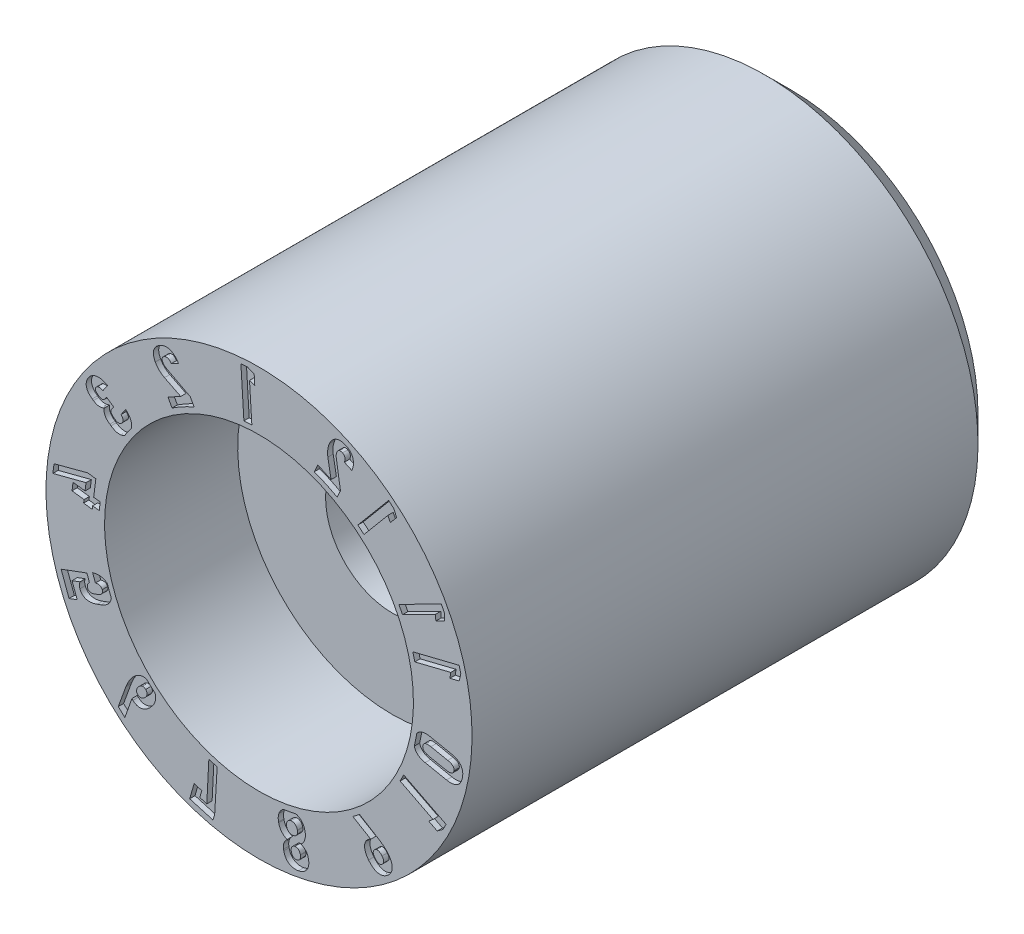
from build123d import *

# Parameters (mm, degrees)
CUT_EXTRUDE1_DEPTH = 0.1


with BuildPart() as part:
    # Sketch1 → Revolve1 (revolve)
    with BuildSketch(Plane(origin=(0, 0, 0), x_dir=(0, 0, -1), z_dir=(1, 0, 0)), mode=Mode.PRIVATE) as revolve1_sk:
        Polygon((10, 1.25), (10, 3.5), (9.5, 4), (0, 4), (0, 2.9), (2.5, 2.9), (2.5, 1.25), align=None)
    revolve(revolve1_sk.sketch.rotate(Axis((0, 0, 0), (0, 0, -1)), 180), axis=Axis((0, 0, 0), (0, 0, -1)))

    # Sketch2 → Cut-Extrude1 (cut)
    # profile 1 of 15: a face of its own
    with BuildSketch(Plane(origin=(0, 0, 0), x_dir=(0, 1, 0), z_dir=(0, 0, 1))):
        Polygon((2.982259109, 0.28374065), (2.991601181, 0.134442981), (3.692433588, 0.178186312), (3.65680991, 0.079246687), (3.837113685, 0.090453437), (3.890374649, 0.212314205), (3.882299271, 0.339773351), align=None)
    # profile 2 of 15: a face of its own
    with BuildSketch(Plane(origin=(0, 0, 0), x_dir=(0, 1, 0), z_dir=(0, 0, 1))):
        with BuildLine():
            ThreePointArc((2.516770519, 1.632748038), (2.636967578, 1.430525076), (2.740949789, 1.219505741))
            Line((2.740949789, 1.219505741), (2.870867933, 1.28958464))
            Line((2.870867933, 1.28958464), (3.098292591, 1.722412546))
            add(Edge.make_bspline(
                [(3.098292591, 1.722412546), (3.107762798, 1.741145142), (3.122587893, 1.762669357), (3.14360978, 1.78494197), (3.157631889, 1.796633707), (3.168218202, 1.804667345), (3.176001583, 1.808504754)],
                knots=[0, 0, 0, 0, 0.534647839, 0.661605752, 0.780088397, 1, 1, 1, 1], degree=3))
            Line((3.176001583, 1.808504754), (3.177066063, 1.80912174))
            add(Edge.make_bspline(
                [(3.177066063, 1.80912174), (3.186734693, 1.813957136), (3.201666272, 1.82045341), (3.222385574, 1.820860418), (3.236632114, 1.818048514), (3.249931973, 1.811876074), (3.266984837, 1.798993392), (3.276504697, 1.785186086), (3.281813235, 1.775123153)],
                knots=[0, 0, 0, 0, 0.26216042, 0.377951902, 0.491640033, 0.607227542, 0.726090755, 1, 1, 1, 1], degree=3))
            add(Edge.make_bspline(
                [(3.281813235, 1.775123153), (3.287445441, 1.765062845), (3.292717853, 1.748313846), (3.291602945, 1.725291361), (3.286603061, 1.708422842), (3.277835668, 1.692070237), (3.260848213, 1.669645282), (3.243398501, 1.655951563), (3.230864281, 1.647278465)],
                knots=[0, 0, 0, 0, 0.22678653, 0.33568016, 0.449024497, 0.569877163, 0.698822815, 1, 1, 1, 1], degree=3))
            Line((3.230864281, 1.647278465), (3.230255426, 1.647020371))
            Line((3.230255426, 1.647020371), (3.30332237, 1.511798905))
            Line((3.30332237, 1.511798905), (3.303931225, 1.512056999))
            add(Edge.make_bspline(
                [(3.303931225, 1.512056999), (3.326479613, 1.525739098), (3.357362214, 1.548921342), (3.392844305, 1.584268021), (3.41413597, 1.611701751), (3.431395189, 1.640025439), (3.444242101, 1.669242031), (3.452775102, 1.699151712), (3.456347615, 1.729735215), (3.455816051, 1.760546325), (3.448435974, 1.802388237), (3.436534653, 1.832500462), (3.426119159, 1.851654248)],
                knots=[0, 0, 0, 0, 0.196205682, 0.2862839, 0.372135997, 0.454136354, 0.532640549, 0.609085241, 0.684816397, 0.761081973, 0.837733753, 1, 1, 1, 1], degree=3))
            add(Edge.make_bspline(
                [(3.426119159, 1.851654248), (3.415094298, 1.871963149), (3.396547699, 1.900371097), (3.365995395, 1.931894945), (3.342142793, 1.950764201), (3.316732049, 1.965536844), (3.290022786, 1.976168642), (3.26184312, 1.98205744), (3.232617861, 1.983852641), (3.202330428, 1.981296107), (3.15967993, 1.971545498), (3.128609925, 1.958109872), (3.108305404, 1.947218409)],
                knots=[0, 0, 0, 0, 0.184007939, 0.267647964, 0.348160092, 0.425105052, 0.500628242, 0.575749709, 0.653062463, 0.732720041, 0.816618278, 1, 1, 1, 1], degree=3))
            Line((3.108305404, 1.947218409), (3.107696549, 1.946960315))
            add(Edge.make_bspline(
                [(3.107696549, 1.946960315), (3.089832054, 1.937118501), (3.063792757, 1.920622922), (3.032012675, 1.894344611), (3.009342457, 1.872894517), (2.988484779, 1.849837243), (2.963681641, 1.817817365), (2.947763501, 1.792198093), (2.93885123, 1.774388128)],
                knots=[0, 0, 0, 0, 0.249859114, 0.376065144, 0.504448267, 0.631713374, 0.7563645, 1, 1, 1, 1], degree=3))
            Line((2.93885123, 1.774388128), (2.785980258, 1.46924481))
            Line((2.785980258, 1.46924481), (2.656775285, 1.70835407))
            Line((2.656775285, 1.70835407), (2.516770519, 1.632748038))
        make_face()
    # profile 3 of 15: a face of its own
    with BuildSketch(Plane(origin=(0, 0, 0), x_dir=(0, 1, 0), z_dir=(0, 0, 1))):
        with BuildLine():
            Line((2.960006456, -1.105599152), (2.814701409, -1.03800577))
            ThreePointArc((2.814701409, -1.03800577), (2.724165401, -1.256551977), (2.616691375, -1.467285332))
            Line((2.616691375, -1.467285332), (2.750596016, -1.529640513))
            Line((2.750596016, -1.529640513), (3.234730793, -1.452612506))
            add(Edge.make_bspline(
                [(3.234730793, -1.452612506), (3.255535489, -1.449397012), (3.295209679, -1.446920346), (3.334003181, -1.455966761), (3.350684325, -1.46354292)],
                knots=[0, 0, 0, 0, 0.536054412, 1, 1, 1, 1], degree=3))
            Line((3.350684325, -1.46354292), (3.351814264, -1.464029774))
            add(Edge.make_bspline(
                [(3.351814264, -1.464029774), (3.361779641, -1.468558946), (3.375285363, -1.47735877), (3.388390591, -1.493399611), (3.394541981, -1.50654339), (3.397520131, -1.520959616), (3.397274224, -1.54255878), (3.391554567, -1.558588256), (3.386851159, -1.569065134)],
                knots=[0, 0, 0, 0, 0.261235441, 0.376365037, 0.489448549, 0.60351318, 0.724398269, 1, 1, 1, 1], degree=3))
            add(Edge.make_bspline(
                [(3.386851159, -1.569065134), (3.382016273, -1.579463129), (3.371863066, -1.593774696), (3.35269566, -1.606537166), (3.336211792, -1.61266497), (3.317807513, -1.615797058), (3.289561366, -1.615138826), (3.268093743, -1.609595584), (3.253661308, -1.60456444)],
                knots=[0, 0, 0, 0, 0.225876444, 0.3346302, 0.447816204, 0.568931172, 0.69919784, 1, 1, 1, 1], degree=3))
            Line((3.253661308, -1.60456444), (3.25316646, -1.604261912))
            Line((3.25316646, -1.604261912), (3.187864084, -1.744214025))
            Line((3.187864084, -1.744214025), (3.188358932, -1.744516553))
            add(Edge.make_bspline(
                [(3.188358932, -1.744516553), (3.212808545, -1.754522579), (3.249870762, -1.765662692), (3.299507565, -1.773109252), (3.334327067, -1.773849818), (3.367419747, -1.770557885), (3.398703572, -1.763581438), (3.42779225, -1.752073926), (3.45465612, -1.736687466), (3.479018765, -1.717573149), (3.508558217, -1.686729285), (3.525388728, -1.6587692), (3.534742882, -1.63894951)],
                knots=[0, 0, 0, 0, 0.195777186, 0.285690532, 0.37146302, 0.453331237, 0.531804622, 0.608367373, 0.684403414, 0.760621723, 0.83722742, 1, 1, 1, 1], degree=3))
            add(Edge.make_bspline(
                [(3.534742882, -1.63894951), (3.544575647, -1.617899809), (3.556270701, -1.585857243), (3.563632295, -1.542340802), (3.564418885, -1.511742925), (3.561113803, -1.482452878), (3.553512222, -1.454576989), (3.541448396, -1.428350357), (3.525434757, -1.403640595), (3.505361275, -1.380728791), (3.472000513, -1.352227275), (3.442728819, -1.33512526), (3.421680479, -1.325508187)],
                knots=[0, 0, 0, 0, 0.184119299, 0.268257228, 0.348520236, 0.425741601, 0.500921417, 0.576347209, 0.653463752, 0.733372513, 0.816720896, 1, 1, 1, 1], degree=3))
            Line((3.421680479, -1.325508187), (3.421045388, -1.325323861))
            add(Edge.make_bspline(
                [(3.421045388, -1.325323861), (3.402484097, -1.316876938), (3.373762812, -1.305737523), (3.333693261, -1.295997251), (3.302903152, -1.290832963), (3.271887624, -1.28767261), (3.231212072, -1.287109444), (3.201027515, -1.289621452), (3.181306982, -1.293032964)],
                knots=[0, 0, 0, 0, 0.249372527, 0.375058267, 0.503348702, 0.630684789, 0.755655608, 1, 1, 1, 1], degree=3))
            Line((3.181306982, -1.293032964), (2.844650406, -1.353221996))
            Line((2.844650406, -1.353221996), (2.960006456, -1.105599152))
        make_face()
    # profile 4 of 15: a face of its own
    with BuildSketch(Plane(origin=(0, 0, 0), x_dir=(0, 1, 0), z_dir=(0, 0, 1))):
        with BuildLine():
            ThreePointArc((1.623515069, 2.522736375), (1.716115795, 2.460680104), (1.806347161, 2.395226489))
            add(Edge.make_bspline(
                [(1.806347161, 2.395226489), (1.812386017, 2.394028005), (1.828855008, 2.39143526), (1.855933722, 2.390124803), (1.88725029, 2.392994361), (1.918186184, 2.400265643), (1.948505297, 2.412079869), (1.977825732, 2.428471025), (2.015975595, 2.456903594), (2.040696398, 2.483895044), (2.055668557, 2.50361923)],
                knots=[0.28470313, 0.28470313, 0.28470313, 0.28470313, 0.33065039, 0.409016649, 0.486552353, 0.564769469, 0.64560457, 0.728786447, 0.814906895, 1, 1, 1, 1], degree=3))
            Line((2.055668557, 2.50361923), (1.92915722, 2.591638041))
            add(Edge.make_bspline(
                [(1.92915722, 2.591638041), (1.923203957, 2.585183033), (1.914089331, 2.576024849), (1.900437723, 2.566377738), (1.890263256, 2.560857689), (1.880067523, 2.55669365), (1.869864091, 2.553782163), (1.859614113, 2.552741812), (1.849429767, 2.552497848), (1.839386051, 2.554304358), (1.825856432, 2.557974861), (1.816568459, 2.563469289), (1.810617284, 2.567449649)],
                knots=[0, 0, 0, 0, 0.197221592, 0.287983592, 0.373853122, 0.456136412, 0.534562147, 0.610690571, 0.686571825, 0.762055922, 0.838541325, 1, 1, 1, 1], degree=3))
            add(Edge.make_bspline(
                [(1.810617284, 2.567449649), (1.800155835, 2.574800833), (1.786020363, 2.587825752), (1.774973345, 2.60999263), (1.771251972, 2.627420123), (1.771448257, 2.64575274), (1.777898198, 2.672253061), (1.78822853, 2.690949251), (1.796565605, 2.703023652)],
                knots=[0, 0, 0, 0, 0.249290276, 0.362503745, 0.474970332, 0.591630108, 0.71489947, 1, 1, 1, 1], degree=3))
            Line((1.796565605, 2.703023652), (1.808550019, 2.720348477))
            add(Edge.make_bspline(
                [(1.808550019, 2.720348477), (1.817394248, 2.732834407), (1.831114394, 2.750097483), (1.853069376, 2.767151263), (1.868921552, 2.775268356), (1.884751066, 2.779765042), (1.906099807, 2.780052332), (1.921005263, 2.773431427), (1.929615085, 2.767364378)],
                knots=[0, 0, 0, 0, 0.315089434, 0.447671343, 0.5676845, 0.678572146, 0.782570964, 1, 1, 1, 1], degree=3))
            Line((1.929615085, 2.767364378), (1.984797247, 2.729075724))
            Line((1.984797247, 2.729075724), (2.078591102, 2.863778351))
            Line((2.078591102, 2.863778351), (2.02340894, 2.902067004))
            add(Edge.make_bspline(
                [(2.02340894, 2.902067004), (2.016214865, 2.906855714), (2.007074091, 2.916792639), (2.00186359, 2.933708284), (2.001015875, 2.947654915), (2.003212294, 2.962767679), (2.01083981, 2.985406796), (2.020502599, 3.001651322), (2.028029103, 3.012468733)],
                knots=[0, 0, 0, 0, 0.21010337, 0.312415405, 0.423519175, 0.546125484, 0.680082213, 1, 1, 1, 1], degree=3))
            Line((2.028029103, 3.012468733), (2.03685454, 3.025109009))
            add(Edge.make_bspline(
                [(2.03685454, 3.025109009), (2.044119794, 3.035131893), (2.055277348, 3.049408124), (2.0739359, 3.062415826), (2.087326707, 3.068762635), (2.101010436, 3.071690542), (2.119671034, 3.07096402), (2.132617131, 3.064674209), (2.140335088, 3.059380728)],
                knots=[0, 0, 0, 0, 0.30362106, 0.432869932, 0.550797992, 0.662155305, 0.770241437, 1, 1, 1, 1], degree=3))
            add(Edge.make_bspline(
                [(2.140335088, 3.059380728), (2.145888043, 3.055876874), (2.152789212, 3.048842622), (2.160171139, 3.03789909), (2.163997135, 3.028548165), (2.167046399, 3.018597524), (2.168237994, 3.007805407), (2.168609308, 2.996371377), (2.167562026, 2.98424893), (2.165079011, 2.971550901), (2.160048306, 2.953287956), (2.154070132, 2.939845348), (2.149636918, 2.930851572)],
                knots=[0, 0, 0, 0, 0.138657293, 0.20819895, 0.279975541, 0.353134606, 0.429318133, 0.510497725, 0.59677776, 0.687956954, 0.785966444, 1, 1, 1, 1], degree=3))
            Line((2.149636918, 2.930851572), (2.275912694, 2.842941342))
            add(Edge.make_bspline(
                [(2.275912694, 2.842941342), (2.289284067, 2.86531208), (2.305827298, 2.899880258), (2.320125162, 2.947530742), (2.326168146, 2.981730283), (2.328137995, 3.014920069), (2.325837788, 3.046811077), (2.319715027, 3.077283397), (2.309045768, 3.105965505), (2.294603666, 3.132615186), (2.270872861, 3.165962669), (2.247193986, 3.186160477), (2.230458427, 3.198202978)],
                knots=[0, 0, 0, 0, 0.196715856, 0.287730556, 0.374805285, 0.458316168, 0.538069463, 0.615548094, 0.692162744, 0.768138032, 0.843835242, 1, 1, 1, 1], degree=3))
            add(Edge.make_bspline(
                [(2.230458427, 3.198202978), (2.216781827, 3.207588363), (2.195920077, 3.220314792), (2.166660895, 3.232538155), (2.145503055, 3.239458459), (2.124323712, 3.243598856), (2.103299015, 3.245290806), (2.082392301, 3.244486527), (2.061713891, 3.241353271), (2.041332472, 3.235787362), (2.021500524, 3.227866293), (2.002238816, 3.217562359), (1.983584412, 3.204953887), (1.965454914, 3.189988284), (1.94170415, 3.165980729), (1.925292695, 3.145795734), (1.915225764, 3.131155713)],
                knots=[0, 0, 0, 0, 0.135869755, 0.198856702, 0.259084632, 0.317670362, 0.374958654, 0.431264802, 0.48845039, 0.545686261, 0.603722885, 0.662784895, 0.724044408, 0.787632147, 0.854771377, 1, 1, 1, 1], degree=3))
            Line((1.915225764, 3.131155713), (1.899693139, 3.108611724))
            add(Edge.make_bspline(
                [(1.899693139, 3.108611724), (1.888480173, 3.092408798), (1.874138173, 3.066771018), (1.86334928, 3.030096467), (1.859210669, 3.003053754), (1.85952933, 2.976274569), (1.865259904, 2.941007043), (1.875889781, 2.916114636), (1.885111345, 2.900695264)],
                knots=[0, 0, 0, 0, 0.267895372, 0.394163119, 0.517049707, 0.637757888, 0.756044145, 1, 1, 1, 1], degree=3))
            add(Edge.make_bspline(
                [(1.885111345, 2.900695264), (1.876105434, 2.90417819), (1.862186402, 2.907575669), (1.843325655, 2.90984045), (1.829294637, 2.909626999), (1.815237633, 2.908208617), (1.801151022, 2.905406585), (1.787090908, 2.900905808), (1.768094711, 2.893129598), (1.744726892, 2.879708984), (1.707950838, 2.850126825), (1.684140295, 2.822038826), (1.669850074, 2.801133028)],
                knots=[0, 0, 0, 0, 0.112728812, 0.167140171, 0.221926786, 0.276605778, 0.332379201, 0.389706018, 0.449147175, 0.57245393, 0.70349579, 1, 1, 1, 1], degree=3))
            Line((1.669850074, 2.801133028), (1.654253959, 2.778761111))
            add(Edge.make_bspline(
                [(1.654253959, 2.778761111), (1.640489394, 2.758461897), (1.621879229, 2.727625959), (1.605940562, 2.684006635), (1.59855118, 2.65290918), (1.596044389, 2.622418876), (1.597717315, 2.592783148), (1.604194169, 2.564073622), (1.613471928, 2.540818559), (1.620754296, 2.527390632), (1.623515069, 2.522736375)],
                knots=[0, 0, 0, 0, 0.190185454, 0.276426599, 0.358418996, 0.436712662, 0.512280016, 0.58720069, 0.663375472, 0.705204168, 0.705204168, 0.705204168, 0.705204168], degree=3))
        make_face()
    # profile 5 of 15: a face of its own
    with BuildSketch(Plane(origin=(0, 0, 0), x_dir=(0, 1, 0), z_dir=(0, 0, 1))):
        with BuildLine():
            Line((3.046584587, -2.433820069), (2.357401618, -1.855440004))
            ThreePointArc((2.357401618, -1.855440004), (2.310250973, -1.913828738), (2.261654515, -1.97101975))
            Line((2.261654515, -1.97101975), (2.79675016, -2.420040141))
            Line((2.79675016, -2.420040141), (2.702571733, -2.467181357))
            Line((2.702571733, -2.467181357), (2.841274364, -2.583561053))
            Line((2.841274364, -2.583561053), (2.964244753, -2.531771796))
            Line((2.964244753, -2.531771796), (3.046584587, -2.433820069))
        make_face()
    # profile 6 of 15: a face of its own
    with BuildSketch(Plane(origin=(0, 0, 0), x_dir=(0, 1, 0), z_dir=(0, 0, 1))):
        with BuildLine():
            ThreePointArc((0.164798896, 2.995470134), (0.23997134, 2.990386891), (0.314992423, 2.983417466))
            Line((0.314992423, 2.983417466), (0.33042181, 3.104258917))
            Line((0.33042181, 3.104258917), (0.649897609, 3.063457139))
            Line((0.649897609, 3.063457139), (0.669736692, 3.21786223))
            Line((0.669736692, 3.21786223), (0.502231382, 3.84883302))
            Line((0.502231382, 3.84883302), (0.333472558, 3.870316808))
            Line((0.333472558, 3.870316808), (0.495182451, 3.247673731))
            Line((0.495182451, 3.247673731), (0.351081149, 3.266060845))
            Line((0.351081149, 3.266060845), (0.379899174, 3.491760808))
            Line((0.379899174, 3.491760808), (0.23060295, 3.510841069))
            Line((0.23060295, 3.510841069), (0.20178112, 3.285111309))
            Line((0.20178112, 3.285111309), (0.139714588, 3.293030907))
            Line((0.139714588, 3.293030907), (0.119095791, 3.131248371))
            Line((0.119095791, 3.131248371), (0.181123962, 3.123326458))
            Line((0.181123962, 3.123326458), (0.164798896, 2.995470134))
        make_face()
    # profile 7 of 15: a face of its own
    with BuildSketch(Plane(origin=(0, 0, 0), x_dir=(0, 1, 0), z_dir=(0, 0, 1))):
        with BuildLine():
            Line((1.85815297, -3.422204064), (1.451404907, -2.62553305))
            ThreePointArc((1.451404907, -2.62553305), (1.385334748, -2.660986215), (1.318399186, -2.694777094))
            Line((1.318399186, -2.694777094), (1.634112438, -3.313249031))
            Line((1.634112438, -3.313249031), (1.528979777, -3.320322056))
            Line((1.528979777, -3.320322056), (1.61073571, -3.480557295))
            Line((1.61073571, -3.480557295), (1.744059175, -3.48050568))
            Line((1.744059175, -3.48050568), (1.85815297, -3.422204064))
        make_face()
    # profile 8 of 15: a face of its own
    with BuildSketch(Plane(origin=(0, 0, 0), x_dir=(0, 1, 0), z_dir=(0, 0, 1))):
        with BuildLine():
            ThreePointArc((-1.144684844, 2.773030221), (-1.046779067, 2.811450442), (-0.947586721, 2.846415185))
            add(Edge.make_bspline(
                [(-0.947586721, 2.846415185), (-0.943588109, 2.850747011), (-0.933289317, 2.862926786), (-0.918646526, 2.884702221), (-0.90544553, 2.912638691), (-0.896010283, 2.943088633), (-0.89010703, 2.975792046), (-0.888377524, 3.010542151), (-0.891300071, 3.060400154), (-0.899416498, 3.098018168), (-0.907157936, 3.1230327)],
                knots=[0.261845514, 0.261845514, 0.261845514, 0.261845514, 0.306408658, 0.382270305, 0.459713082, 0.53928686, 0.622794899, 0.710469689, 0.801870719, 1, 1, 1, 1], degree=3))
            Line((-0.907157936, 3.1230327), (-0.907376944, 3.12356976))
            Line((-0.907376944, 3.12356976), (-1.048605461, 3.071302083))
            Line((-1.048605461, 3.071302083), (-1.048386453, 3.070765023))
            add(Edge.make_bspline(
                [(-1.048386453, 3.070765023), (-1.04444888, 3.056319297), (-1.040976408, 3.034914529), (-1.042219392, 3.007271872), (-1.046459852, 2.989381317), (-1.053495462, 2.973550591), (-1.067591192, 2.955855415), (-1.082141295, 2.946827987), (-1.092767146, 2.943052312)],
                knots=[0, 0, 0, 0, 0.299835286, 0.43058063, 0.55155475, 0.666048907, 0.774575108, 1, 1, 1, 1], degree=3))
            add(Edge.make_bspline(
                [(-1.092767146, 2.943052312), (-1.104024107, 2.938876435), (-1.121980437, 2.935696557), (-1.145208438, 2.940523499), (-1.161092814, 2.948552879), (-1.175583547, 2.960596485), (-1.194078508, 2.982815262), (-1.203665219, 3.003584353), (-1.209269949, 3.018311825)],
                knots=[0, 0, 0, 0, 0.230735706, 0.338465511, 0.449164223, 0.568136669, 0.696941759, 1, 1, 1, 1], degree=3))
            Line((-1.209269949, 3.018311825), (-1.235334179, 3.088985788))
            add(Edge.make_bspline(
                [(-1.235334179, 3.088985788), (-1.24106238, 3.103684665), (-1.24696661, 3.125513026), (-1.248488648, 3.154010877), (-1.246044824, 3.172141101), (-1.240346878, 3.187956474), (-1.228321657, 3.206079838), (-1.213946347, 3.214520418), (-1.203964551, 3.218345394)],
                knots=[0, 0, 0, 0, 0.316359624, 0.44900789, 0.569721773, 0.680548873, 0.783419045, 1, 1, 1, 1], degree=3))
            add(Edge.make_bspline(
                [(-1.203964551, 3.218345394), (-1.194494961, 3.222021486), (-1.179577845, 3.225261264), (-1.159683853, 3.224104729), (-1.145477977, 3.220672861), (-1.132133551, 3.214612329), (-1.114948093, 3.203277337), (-1.10432475, 3.191481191), (-1.098217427, 3.182670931)],
                knots=[0, 0, 0, 0, 0.251986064, 0.372077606, 0.491574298, 0.612295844, 0.733710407, 1, 1, 1, 1], degree=3))
            Line((-1.098217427, 3.182670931), (-0.966218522, 3.231613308))
            Line((-0.966218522, 3.231613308), (-1.145342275, 3.715410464))
            Line((-1.145342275, 3.715410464), (-1.54802252, 3.566233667))
            Line((-1.54802252, 3.566233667), (-1.491434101, 3.413488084))
            Line((-1.491434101, 3.413488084), (-1.229862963, 3.510257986))
            Line((-1.229862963, 3.510257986), (-1.174787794, 3.361530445))
            add(Edge.make_bspline(
                [(-1.174787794, 3.361530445), (-1.182541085, 3.365646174), (-1.195517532, 3.369721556), (-1.213867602, 3.372485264), (-1.228804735, 3.372995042), (-1.244000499, 3.372419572), (-1.263799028, 3.36977942), (-1.278174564, 3.366003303), (-1.287347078, 3.362607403)],
                knots=[0, 0, 0, 0, 0.227094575, 0.35104414, 0.481487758, 0.615031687, 0.745958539, 1, 1, 1, 1], degree=3))
            add(Edge.make_bspline(
                [(-1.287347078, 3.362607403), (-1.305716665, 3.356117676), (-1.331294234, 3.342459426), (-1.35963869, 3.317392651), (-1.376670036, 3.29584093), (-1.390076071, 3.27160747), (-1.399699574, 3.244722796), (-1.405331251, 3.215264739), (-1.407288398, 3.183436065), (-1.405315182, 3.149414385), (-1.397346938, 3.099562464), (-1.386168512, 3.061952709), (-1.376562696, 3.036718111)],
                knots=[0, 0, 0, 0, 0.153113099, 0.22527841, 0.296312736, 0.368148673, 0.442248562, 0.5200006, 0.603336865, 0.692521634, 0.787561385, 1, 1, 1, 1], degree=3))
            Line((-1.376562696, 3.036718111), (-1.350498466, 2.966044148))
            add(Edge.make_bspline(
                [(-1.350498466, 2.966044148), (-1.3409452, 2.940785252), (-1.324723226, 2.904759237), (-1.296358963, 2.862424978), (-1.273561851, 2.836041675), (-1.248982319, 2.813916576), (-1.222488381, 2.796399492), (-1.194324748, 2.783408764), (-1.168079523, 2.776140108), (-1.151327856, 2.773671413), (-1.144684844, 2.773030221)],
                knots=[0, 0, 0, 0, 0.19719032, 0.286519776, 0.370800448, 0.450893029, 0.52696837, 0.601590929, 0.676168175, 0.724800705, 0.724800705, 0.724800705, 0.724800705], degree=3))
        make_face()
    # profile 9 of 15: a face of its own
    with BuildSketch(Plane(origin=(0, 0, 0), x_dir=(0, 1, 0), z_dir=(0, 0, 1))):
        with BuildLine():
            Line((1.02770729, -3.758310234), (0.812653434, -2.88783559))
            ThreePointArc((0.812653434, -2.88783559), (0.740028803, -2.907293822), (0.666939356, -2.924925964))
            Line((0.666939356, -2.924925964), (0.833765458, -3.600506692))
            Line((0.833765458, -3.600506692), (0.7294988, -3.58372598))
            Line((0.7294988, -3.58372598), (0.772735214, -3.758622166))
            Line((0.772735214, -3.758622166), (0.903025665, -3.789094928))
            Line((0.903025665, -3.789094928), (1.02770729, -3.758310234))
        make_face()
    # profile 10 of 15: a face of its own
    with BuildSketch(Plane(origin=(0, 0, 0), x_dir=(0, 1, 0), z_dir=(0, 0, 1))):
        with BuildLine():
            ThreePointArc((-2.276063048, 1.95436358), (-2.20569862, 2.033443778), (-2.132588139, 2.109992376))
            add(Edge.make_bspline(
                [(-2.132588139, 2.109992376), (-2.130304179, 2.117084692), (-2.125798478, 2.13402263), (-2.122377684, 2.161478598), (-2.123990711, 2.191964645), (-2.129734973, 2.222709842), (-2.140755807, 2.253442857), (-2.156547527, 2.283858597), (-2.184207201, 2.325586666), (-2.211238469, 2.353490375), (-2.230457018, 2.371736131)],
                knots=[0.26822223, 0.26822223, 0.26822223, 0.26822223, 0.323460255, 0.398019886, 0.472471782, 0.549124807, 0.629343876, 0.713762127, 0.802904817, 1, 1, 1, 1], degree=3))
            Line((-2.230457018, 2.371736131), (-2.230852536, 2.372071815))
            add(Edge.make_bspline(
                [(-2.230852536, 2.372071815), (-2.243259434, 2.383302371), (-2.262865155, 2.399593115), (-2.291057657, 2.419615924), (-2.337645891, 2.449851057), (-2.379767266, 2.470721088), (-2.41440539, 2.48550116)],
                knots=[0, 0, 0, 0, 0.231613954, 0.352297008, 0.478376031, 1, 1, 1, 1], degree=3))
            add(Edge.make_bspline(
                [(-2.41440539, 2.48550116), (-2.420629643, 2.487909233), (-2.432510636, 2.493322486), (-2.444796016, 2.497761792), (-2.450894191, 2.499629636)],
                knots=[0, 0, 0, 0, 0.511303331, 1, 1, 1, 1], degree=3))
            Line((-2.450894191, 2.499629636), (-2.843881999, 2.64247956))
            Line((-2.843881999, 2.64247956), (-2.958471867, 2.51808762))
            Line((-2.958471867, 2.51808762), (-2.58249144, 2.384964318))
            add(Edge.make_bspline(
                [(-2.58249144, 2.384964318), (-2.590450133, 2.379444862), (-2.597684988, 2.372864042), (-2.604277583, 2.365806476)],
                knots=[0.767037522, 0.767037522, 0.767037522, 0.767037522, 1, 1, 1, 1], degree=3))
            add(Edge.make_bspline(
                [(-2.604277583, 2.365806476), (-2.618035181, 2.350624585), (-2.636103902, 2.326184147), (-2.651335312, 2.289721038), (-2.657818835, 2.262209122), (-2.659816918, 2.234014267), (-2.656975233, 2.205366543), (-2.649686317, 2.176420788), (-2.637906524, 2.147240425), (-2.621835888, 2.117959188), (-2.593191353, 2.077992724), (-2.56710646, 2.050207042), (-2.547749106, 2.03256315)],
                knots=[0, 0, 0, 0, 0.161009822, 0.235421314, 0.308506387, 0.381742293, 0.456067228, 0.533316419, 0.615065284, 0.702208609, 0.794636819, 1, 1, 1, 1], degree=3))
            Line((-2.547749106, 2.03256315), (-2.54715583, 2.032059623))
            add(Edge.make_bspline(
                [(-2.54715583, 2.032059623), (-2.527435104, 2.013922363), (-2.496784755, 1.989427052), (-2.452669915, 1.964651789), (-2.420676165, 1.951502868), (-2.389052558, 1.942725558), (-2.357771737, 1.939167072), (-2.327015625, 1.940319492), (-2.299707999, 1.945774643), (-2.282992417, 1.951531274), (-2.276063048, 1.95436358)],
                knots=[0, 0, 0, 0, 0.197416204, 0.287305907, 0.371656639, 0.451534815, 0.528162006, 0.602502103, 0.677266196, 0.732329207, 0.732329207, 0.732329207, 0.732329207], degree=3))
        make_face()
        with BuildLine():
            add(Edge.make_bspline(
                [(-2.30824299, 2.128163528), (-2.316363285, 2.119372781), (-2.330318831, 2.107810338), (-2.352586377, 2.101055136), (-2.369393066, 2.100098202), (-2.386694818, 2.103105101), (-2.411193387, 2.112794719), (-2.427744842, 2.125340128), (-2.438172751, 2.135013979)],
                knots=[0, 0, 0, 0, 0.245303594, 0.355949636, 0.467802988, 0.584426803, 0.710018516, 1, 1, 1, 1], degree=3))
            Line((-2.438172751, 2.135013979), (-2.438766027, 2.135517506))
            add(Edge.make_bspline(
                [(-2.438766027, 2.135517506), (-2.45063586, 2.146824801), (-2.46703596, 2.16394052), (-2.481571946, 2.19010116), (-2.487430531, 2.208454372), (-2.489376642, 2.226418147), (-2.485173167, 2.250029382), (-2.475752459, 2.265787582), (-2.467254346, 2.274517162)],
                knots=[0, 0, 0, 0, 0.30801047, 0.438104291, 0.556605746, 0.666435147, 0.772703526, 1, 1, 1, 1], degree=3))
            add(Edge.make_bspline(
                [(-2.467254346, 2.274517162), (-2.459340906, 2.283381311), (-2.444605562, 2.294216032), (-2.42139046, 2.299600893), (-2.40313237, 2.299340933), (-2.384271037, 2.294486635), (-2.356866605, 2.282366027), (-2.338318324, 2.26754282), (-2.326115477, 2.256622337)],
                knots=[0, 0, 0, 0, 0.223239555, 0.329763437, 0.44127532, 0.561816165, 0.691908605, 1, 1, 1, 1], degree=3))
            Line((-2.326115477, 2.256622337), (-2.32590276, 2.256271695))
            add(Edge.make_bspline(
                [(-2.32590276, 2.256271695), (-2.315537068, 2.246429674), (-2.301427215, 2.231138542), (-2.289768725, 2.207522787), (-2.285484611, 2.190669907), (-2.285187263, 2.173908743), (-2.290387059, 2.151556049), (-2.300277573, 2.136811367), (-2.30824299, 2.128163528)],
                knots=[0, 0, 0, 0, 0.293937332, 0.418673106, 0.53526639, 0.64684047, 0.758393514, 1, 1, 1, 1], degree=3))
        make_face(mode=Mode.SUBTRACT)
    # profile 11 of 15: a face of its own
    with BuildSketch(Plane(origin=(0, 0, 0), x_dir=(0, 1, 0), z_dir=(0, 0, 1))):
        with BuildLine():
            add(Edge.make_bspline(
                [(-0.404437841, -3.214515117), (-0.400678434, -3.1957549), (-0.396636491, -3.167917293), (-0.395927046, -3.131429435), (-0.397563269, -3.106027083), (-0.401608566, -3.081955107), (-0.407759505, -3.059132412), (-0.416072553, -3.037536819), (-0.426696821, -3.017284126), (-0.439517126, -2.998543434), (-0.45441561, -2.981359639), (-0.467645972, -2.9694375), (-0.475828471, -2.963230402), (-0.477954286, -2.961681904)],
                knots=[0, 0, 0, 0, 0.143965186, 0.210815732, 0.274145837, 0.335115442, 0.39407029, 0.451622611, 0.508784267, 0.565664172, 0.622004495, 0.679439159, 0.699211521, 0.699211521, 0.699211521, 0.699211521], degree=3))
            ThreePointArc((-0.477954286, -2.961681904), (-0.593176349, -2.940772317), (-0.707494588, -2.915381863))
            add(Edge.make_bspline(
                [(-0.707494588, -2.915381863), (-0.710128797, -2.916040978), (-0.720071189, -2.91873568), (-0.736961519, -2.92453703), (-0.757415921, -2.934523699), (-0.776383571, -2.947088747), (-0.793932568, -2.961762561), (-0.810172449, -2.978265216), (-0.824561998, -2.997016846), (-0.837417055, -3.017732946), (-0.848971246, -3.040234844), (-0.86208888, -3.074036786), (-0.869640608, -3.100805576), (-0.873128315, -3.119517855)],
                knots=[0.302059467, 0.302059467, 0.302059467, 0.302059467, 0.322469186, 0.37945588, 0.436176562, 0.493194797, 0.550174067, 0.607993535, 0.667007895, 0.727571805, 0.791206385, 0.856988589, 1, 1, 1, 1], degree=3))
            Line((-0.873128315, -3.119517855), (-0.954565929, -3.52107715))
            add(Edge.make_bspline(
                [(-0.954565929, -3.52107715), (-0.958329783, -3.539838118), (-0.962359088, -3.567673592), (-0.963087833, -3.604164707), (-0.961398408, -3.629610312), (-0.957513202, -3.653762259), (-0.951303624, -3.676624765), (-0.943017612, -3.698234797), (-0.932353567, -3.718394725), (-0.919779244, -3.737293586), (-0.90455501, -3.754086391), (-0.887658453, -3.769647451), (-0.86826131, -3.782942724), (-0.847105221, -3.795003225), (-0.814912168, -3.808590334), (-0.78899075, -3.815772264), (-0.770966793, -3.819365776)],
                knots=[0, 0, 0, 0, 0.143926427, 0.210758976, 0.27407203, 0.33541393, 0.394352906, 0.451889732, 0.509035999, 0.565514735, 0.622053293, 0.679038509, 0.737819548, 0.798426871, 0.861859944, 1, 1, 1, 1], degree=3))
            add(Edge.make_bspline(
                [(-0.770966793, -3.819365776), (-0.752964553, -3.82321453), (-0.726199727, -3.826279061), (-0.69122357, -3.826601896), (-0.66692849, -3.823877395), (-0.643980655, -3.818934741), (-0.622252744, -3.811569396), (-0.601941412, -3.801683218), (-0.582823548, -3.789655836), (-0.565359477, -3.775043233), (-0.549163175, -3.758581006), (-0.534728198, -3.739785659), (-0.52187914, -3.718993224), (-0.510249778, -3.696329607), (-0.496904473, -3.66221053), (-0.489689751, -3.634951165), (-0.485875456, -3.616074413)],
                knots=[0, 0, 0, 0, 0.138147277, 0.201977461, 0.262446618, 0.321467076, 0.378090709, 0.434409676, 0.4908709, 0.547386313, 0.605148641, 0.664104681, 0.725062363, 0.788634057, 0.855269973, 1, 1, 1, 1], degree=3))
            Line((-0.485875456, -3.616074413), (-0.404437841, -3.214515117))
        make_face()
        with BuildLine():
            add(Edge.make_bspline(
                [(-0.620537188, -3.076483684), (-0.613518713, -3.077824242), (-0.603507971, -3.081016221), (-0.59129385, -3.087144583), (-0.583348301, -3.092670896), (-0.57649954, -3.099280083), (-0.570327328, -3.10654268), (-0.565432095, -3.115006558), (-0.55991431, -3.127643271), (-0.555538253, -3.14589045), (-0.553365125, -3.180591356), (-0.556715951, -3.208063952), (-0.560784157, -3.227051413)],
                knots=[0, 0, 0, 0, 0.116631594, 0.170744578, 0.222883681, 0.274114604, 0.325965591, 0.378133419, 0.433270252, 0.550994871, 0.682397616, 1, 1, 1, 1], degree=3))
            Line((-0.560784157, -3.227051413), (-0.624893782, -3.543562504))
            add(Edge.make_bspline(
                [(-0.624893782, -3.543562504), (-0.62884451, -3.56257509), (-0.636114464, -3.589373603), (-0.651704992, -3.620557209), (-0.664729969, -3.638236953), (-0.680083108, -3.651394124), (-0.704530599, -3.662385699), (-0.725265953, -3.661773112), (-0.738466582, -3.659108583)],
                knots=[0, 0, 0, 0, 0.318220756, 0.450596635, 0.56822531, 0.675115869, 0.777705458, 1, 1, 1, 1], degree=3))
            add(Edge.make_bspline(
                [(-0.738466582, -3.659108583), (-0.745379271, -3.657500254), (-0.755669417, -3.654967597), (-0.767686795, -3.648397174), (-0.775593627, -3.642897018), (-0.782627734, -3.636572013), (-0.788559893, -3.62914945), (-0.793679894, -3.620883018), (-0.798891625, -3.608088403), (-0.803346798, -3.589850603), (-0.806117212, -3.555043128), (-0.801905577, -3.527495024), (-0.798388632, -3.508469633)],
                knots=[0, 0, 0, 0, 0.116594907, 0.170753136, 0.222855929, 0.27370912, 0.324640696, 0.37757901, 0.431957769, 0.549600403, 0.68271823, 1, 1, 1, 1], degree=3))
            Line((-0.798388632, -3.508469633), (-0.734279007, -3.191958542))
            add(Edge.make_bspline(
                [(-0.734279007, -3.191958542), (-0.730415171, -3.172930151), (-0.723023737, -3.14620571), (-0.707138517, -3.11523653), (-0.694160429, -3.097665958), (-0.679003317, -3.084298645), (-0.654478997, -3.073465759), (-0.633809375, -3.073623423), (-0.620537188, -3.076483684)],
                knots=[0, 0, 0, 0, 0.318458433, 0.450036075, 0.567771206, 0.674303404, 0.776985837, 1, 1, 1, 1], degree=3))
        make_face(mode=Mode.SUBTRACT)
    # profile 12 of 15: a face of its own
    with BuildSketch(Plane(origin=(0, 0, 0), x_dir=(0, 1, 0), z_dir=(0, 0, 1))):
        with BuildLine():
            ThreePointArc((-2.895305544, 0.785624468), (-2.872836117, 0.864183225), (-2.84823557, 0.942100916))
            Line((-2.84823557, 0.942100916), (-3.594500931, 0.979983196))
            Line((-3.594500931, 0.979983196), (-3.556428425, 1.111641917))
            Line((-3.556428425, 1.111641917), (-3.425896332, 1.073845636))
            Line((-3.425896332, 1.073845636), (-3.384083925, 1.218322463))
            Line((-3.384083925, 1.218322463), (-3.672008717, 1.30151587))
            Line((-3.672008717, 1.30151587), (-3.798648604, 0.863423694))
            Line((-3.798648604, 0.863423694), (-3.690062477, 0.83208301))
            Line((-3.690062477, 0.83208301), (-2.895305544, 0.785624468))
        make_face()
    # profile 13 of 15: a face of its own
    with BuildSketch(Plane(origin=(0, 0, 0), x_dir=(0, 1, 0), z_dir=(0, 0, 1))):
        with BuildLine():
            Line((-1.680189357, -3.512334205), (-1.274308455, -2.71590463))
            ThreePointArc((-1.274308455, -2.71590463), (-1.341748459, -2.683227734), (-1.408351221, -2.648876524))
            Line((-1.408351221, -2.648876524), (-1.723449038, -3.266998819))
            Line((-1.723449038, -3.266998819), (-1.790725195, -3.186197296))
            Line((-1.790725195, -3.186197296), (-1.87234461, -3.346314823))
            Line((-1.87234461, -3.346314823), (-1.794262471, -3.454175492))
            Line((-1.794262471, -3.454175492), (-1.680189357, -3.512334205))
        make_face()
    # profile 14 of 15: a face of its own
    with BuildSketch(Plane(origin=(0, 0, 0), x_dir=(0, 1, 0), z_dir=(0, 0, 1))):
        with BuildLine():
            ThreePointArc((-2.920128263, -0.68764157), (-2.944918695, -0.572235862), (-2.965150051, -0.455944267))
            add(Edge.make_bspline(
                [(-2.965150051, -0.455944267), (-2.968385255, -0.451405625), (-2.978239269, -0.438525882), (-2.996513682, -0.419015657), (-3.021158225, -0.39920608), (-3.048633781, -0.383570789), (-3.078218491, -0.371516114), (-3.10988466, -0.363609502), (-3.155273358, -0.358972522), (-3.190073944, -0.362394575), (-3.213218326, -0.366840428)],
                knots=[0.302804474, 0.302804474, 0.302804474, 0.302804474, 0.344479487, 0.42399517, 0.502242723, 0.580120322, 0.659705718, 0.740593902, 0.823475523, 1, 1, 1, 1], degree=3))
            Line((-3.213218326, -0.366840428), (-3.227752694, -0.369544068))
            add(Edge.make_bspline(
                [(-3.227752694, -0.369544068), (-3.249300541, -0.373981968), (-3.281111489, -0.383867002), (-3.319523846, -0.405810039), (-3.346388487, -0.425339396), (-3.370167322, -0.448101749), (-3.396814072, -0.481199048), (-3.410891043, -0.509571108), (-3.417215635, -0.529314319)],
                knots=[0, 0, 0, 0, 0.254841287, 0.381028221, 0.510143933, 0.638012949, 0.760517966, 1, 1, 1, 1], degree=3))
            add(Edge.make_bspline(
                [(-3.417215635, -0.529314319), (-3.428655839, -0.51578052), (-3.448406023, -0.497419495), (-3.479441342, -0.47926282), (-3.504607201, -0.468634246), (-3.530851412, -0.461072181), (-3.566491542, -0.455657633), (-3.593495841, -0.45760612), (-3.611027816, -0.46080231)],
                knots=[0, 0, 0, 0, 0.247096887, 0.371663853, 0.499381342, 0.626859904, 0.75135401, 1, 1, 1, 1], degree=3))
            Line((-3.611027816, -0.46080231), (-3.634173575, -0.46520271))
            add(Edge.make_bspline(
                [(-3.634173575, -0.46520271), (-3.656117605, -0.469130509), (-3.687428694, -0.479215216), (-3.725679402, -0.498888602), (-3.750581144, -0.516973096), (-3.772319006, -0.537806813), (-3.790679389, -0.56117569), (-3.805433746, -0.586942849), (-3.816584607, -0.614932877), (-3.823915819, -0.64483419), (-3.828222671, -0.687774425), (-3.825277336, -0.72068366), (-3.821041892, -0.742603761)],
                knots=[0, 0, 0, 0, 0.177214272, 0.260427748, 0.341701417, 0.421474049, 0.499587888, 0.577634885, 0.657211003, 0.738857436, 0.822088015, 1, 1, 1, 1], degree=3))
            add(Edge.make_bspline(
                [(-3.821041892, -0.742603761), (-3.817062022, -0.764659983), (-3.806945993, -0.796089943), (-3.787218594, -0.834449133), (-3.769135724, -0.859354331), (-3.748294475, -0.881078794), (-3.724991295, -0.899458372), (-3.699168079, -0.914015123), (-3.671249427, -0.925201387), (-3.641389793, -0.932474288), (-3.598602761, -0.936962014), (-3.56580034, -0.933949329), (-3.543980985, -0.929609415)],
                knots=[0, 0, 0, 0, 0.178260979, 0.261510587, 0.342819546, 0.422626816, 0.500774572, 0.578472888, 0.658083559, 0.739765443, 0.822601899, 1, 1, 1, 1], degree=3))
            Line((-3.543980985, -0.929609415), (-3.520835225, -0.925209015))
            add(Edge.make_bspline(
                [(-3.520835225, -0.925209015), (-3.502984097, -0.921933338), (-3.47709719, -0.912987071), (-3.445645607, -0.894552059), (-3.42431021, -0.877220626), (-3.40497979, -0.857873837), (-3.38361391, -0.828903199), (-3.372353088, -0.804450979), (-3.367199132, -0.787420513)],
                knots=[0, 0, 0, 0, 0.250872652, 0.375914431, 0.503187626, 0.630626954, 0.753796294, 1, 1, 1, 1], degree=3))
            add(Edge.make_bspline(
                [(-3.367199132, -0.787420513), (-3.353603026, -0.803367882), (-3.329944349, -0.824860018), (-3.29261682, -0.845797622), (-3.262081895, -0.858142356), (-3.229954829, -0.866860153), (-3.186054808, -0.872527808), (-3.15287381, -0.870492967), (-3.131256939, -0.866218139)],
                knots=[0, 0, 0, 0, 0.241585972, 0.363924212, 0.491457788, 0.620230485, 0.746402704, 1, 1, 1, 1], degree=3))
            Line((-3.131256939, -0.866218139), (-3.116722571, -0.863514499))
            add(Edge.make_bspline(
                [(-3.116722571, -0.863514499), (-3.09355717, -0.858904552), (-3.059983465, -0.849037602), (-3.019792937, -0.827374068), (-2.993512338, -0.808212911), (-2.970242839, -0.786300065), (-2.951082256, -0.761219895), (-2.935301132, -0.733829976), (-2.925824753, -0.708776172), (-2.921450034, -0.693097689), (-2.920128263, -0.68764157)],
                knots=[0, 0, 0, 0, 0.17711402, 0.259567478, 0.340729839, 0.420043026, 0.498007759, 0.576223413, 0.655896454, 0.697903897, 0.697903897, 0.697903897, 0.697903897], degree=3))
        make_face()
        with BuildLine():
            add(Edge.make_bspline(
                [(-3.459020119, -0.672190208), (-3.457373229, -0.680169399), (-3.456585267, -0.692337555), (-3.459020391, -0.708097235), (-3.462611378, -0.719167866), (-3.467724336, -0.72958041), (-3.474418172, -0.739187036), (-3.482443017, -0.748134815), (-3.492150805, -0.755896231), (-3.503176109, -0.762651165), (-3.51961942, -0.770766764), (-3.533309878, -0.774311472), (-3.542638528, -0.776170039)],
                knots=[0, 0, 0, 0, 0.162789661, 0.241205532, 0.317593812, 0.394654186, 0.472303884, 0.551043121, 0.634186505, 0.719809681, 0.809265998, 1, 1, 1, 1], degree=3))
            Line((-3.542638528, -0.776170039), (-3.551249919, -0.777866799))
            add(Edge.make_bspline(
                [(-3.551249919, -0.777866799), (-3.560025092, -0.779457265), (-3.57319719, -0.781075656), (-3.590309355, -0.779460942), (-3.602234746, -0.777234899), (-3.61325767, -0.773352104), (-3.62346749, -0.768219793), (-3.632628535, -0.761623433), (-3.640802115, -0.753732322), (-3.647829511, -0.74471853), (-3.655510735, -0.730850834), (-3.659306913, -0.719374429), (-3.660794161, -0.711329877)],
                knots=[0, 0, 0, 0, 0.186051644, 0.273035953, 0.356599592, 0.437679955, 0.51517306, 0.593464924, 0.67142583, 0.750702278, 0.830172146, 1, 1, 1, 1], degree=3))
            add(Edge.make_bspline(
                [(-3.660794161, -0.711329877), (-3.662367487, -0.70336628), (-3.663267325, -0.691304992), (-3.661259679, -0.675620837), (-3.658206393, -0.664563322), (-3.653279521, -0.654330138), (-3.647337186, -0.644674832), (-3.639704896, -0.63602713), (-3.630794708, -0.628287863), (-3.620526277, -0.621584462), (-3.604974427, -0.61399988), (-3.592181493, -0.610362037), (-3.583370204, -0.608664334)],
                knots=[0, 0, 0, 0, 0.168145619, 0.248098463, 0.326624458, 0.404576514, 0.482600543, 0.560758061, 0.64245698, 0.72640207, 0.814011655, 1, 1, 1, 1], degree=3))
            Line((-3.583370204, -0.608664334), (-3.574418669, -0.606830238))
            add(Edge.make_bspline(
                [(-3.574418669, -0.606830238), (-3.565194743, -0.605013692), (-3.55139, -0.603737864), (-3.533377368, -0.604726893), (-3.520820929, -0.607068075), (-3.5091124, -0.610796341), (-3.498212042, -0.615686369), (-3.488657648, -0.622332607), (-3.479920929, -0.629873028), (-3.472555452, -0.638876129), (-3.464349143, -0.652569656), (-3.460449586, -0.664138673), (-3.459020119, -0.672190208)],
                knots=[0, 0, 0, 0, 0.189228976, 0.277924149, 0.362657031, 0.445763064, 0.525058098, 0.602259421, 0.679372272, 0.756887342, 0.835452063, 1, 1, 1, 1], degree=3))
        make_face(mode=Mode.SUBTRACT)
        with BuildLine():
            add(Edge.make_bspline(
                [(-3.079876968, -0.598621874), (-3.078089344, -0.608026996), (-3.076803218, -0.62228683), (-3.0793066, -0.640837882), (-3.083007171, -0.653924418), (-3.08848555, -0.66622672), (-3.095776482, -0.677527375), (-3.104544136, -0.687956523), (-3.115166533, -0.696995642), (-3.126871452, -0.705206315), (-3.144776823, -0.714267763), (-3.159541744, -0.718452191), (-3.169704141, -0.720536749)],
                knots=[0, 0, 0, 0, 0.169074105, 0.249698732, 0.328832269, 0.408119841, 0.486188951, 0.565263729, 0.647423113, 0.731373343, 0.816866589, 1, 1, 1, 1], degree=3))
            Line((-3.169704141, -0.720536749), (-3.17814546, -0.722164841))
            add(Edge.make_bspline(
                [(-3.17814546, -0.722164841), (-3.187542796, -0.723898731), (-3.201681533, -0.725236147), (-3.220131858, -0.723256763), (-3.232965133, -0.719920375), (-3.24489737, -0.714912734), (-3.256081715, -0.708766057), (-3.266062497, -0.700705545), (-3.275016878, -0.691289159), (-3.282709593, -0.680477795), (-3.291586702, -0.664066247), (-3.295452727, -0.65024602), (-3.297444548, -0.640775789)],
                knots=[0, 0, 0, 0, 0.17668076, 0.26003316, 0.341553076, 0.420595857, 0.498534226, 0.576398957, 0.656491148, 0.737823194, 0.820738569, 1, 1, 1, 1], degree=3))
            add(Edge.make_bspline(
                [(-3.297444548, -0.640775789), (-3.299279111, -0.631326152), (-3.300531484, -0.617078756), (-3.298681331, -0.598541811), (-3.295473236, -0.585619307), (-3.290633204, -0.573545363), (-3.28424579, -0.562383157), (-3.276154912, -0.552357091), (-3.26681871, -0.543183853), (-3.25601264, -0.535301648), (-3.23961358, -0.526495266), (-3.225944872, -0.522588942), (-3.21656891, -0.520695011)],
                knots=[0, 0, 0, 0, 0.177301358, 0.261424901, 0.342062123, 0.421702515, 0.500317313, 0.577974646, 0.65827307, 0.740752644, 0.823447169, 1, 1, 1, 1], degree=3))
            Line((-3.21656891, -0.520695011), (-3.207447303, -0.518792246))
            add(Edge.make_bspline(
                [(-3.207447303, -0.518792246), (-3.197324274, -0.516882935), (-3.182139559, -0.515366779), (-3.16225991, -0.516920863), (-3.14845588, -0.520218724), (-3.135430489, -0.524758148), (-3.123524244, -0.531134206), (-3.112703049, -0.538981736), (-3.103152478, -0.548395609), (-3.095080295, -0.559287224), (-3.085685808, -0.575462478), (-3.081759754, -0.58926161), (-3.079876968, -0.598621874)],
                knots=[0, 0, 0, 0, 0.182585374, 0.268835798, 0.352094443, 0.433434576, 0.512646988, 0.590514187, 0.669615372, 0.749249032, 0.830155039, 1, 1, 1, 1], degree=3))
        make_face(mode=Mode.SUBTRACT)
    # profile 15 of 15: a face of its own
    with BuildSketch(Plane(origin=(0, 0, 0), x_dir=(0, 1, 0), z_dir=(0, 0, 1))):
        with BuildLine():
            Line((-2.539777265, -2.225991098), (-2.331856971, -1.887443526))
            ThreePointArc((-2.331856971, -1.887443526), (-2.381069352, -1.824968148), (-2.428608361, -1.761210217))
            Line((-2.428608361, -1.761210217), (-2.629356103, -2.099412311))
            add(Edge.make_bspline(
                [(-2.629356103, -2.099412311), (-2.629583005, -2.098740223), (-2.631592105, -2.092948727), (-2.638673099, -2.076404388), (-2.648509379, -2.062082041), (-2.655682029, -2.052723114)],
                knots=[0.575993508, 0.575993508, 0.575993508, 0.575993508, 0.592743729, 0.720735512, 1, 1, 1, 1], degree=3))
            add(Edge.make_bspline(
                [(-2.655682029, -2.052723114), (-2.667449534, -2.03767853), (-2.688031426, -2.01757586), (-2.720836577, -1.998867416), (-2.747044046, -1.98916328), (-2.774721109, -1.983555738), (-2.803624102, -1.981562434), (-2.833573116, -1.984573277), (-2.864391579, -1.991032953), (-2.895577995, -2.001729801), (-2.938463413, -2.021649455), (-2.968521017, -2.042223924), (-2.988127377, -2.057366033)],
                knots=[0, 0, 0, 0, 0.154016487, 0.228362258, 0.302765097, 0.378155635, 0.455155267, 0.535205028, 0.619793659, 0.708331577, 0.800166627, 1, 1, 1, 1], degree=3))
            Line((-2.988127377, -2.057366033), (-2.988613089, -2.057814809))
            add(Edge.make_bspline(
                [(-2.988613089, -2.057814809), (-3.010095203, -2.074468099), (-3.039183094, -2.101390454), (-3.071077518, -2.141332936), (-3.089493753, -2.170935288), (-3.103268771, -2.201049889), (-3.111655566, -2.231581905), (-3.115857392, -2.262189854), (-3.114546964, -2.292902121), (-3.108647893, -2.323537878), (-3.093387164, -2.364909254), (-3.075264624, -2.393611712), (-3.061023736, -2.411657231)],
                knots=[0, 0, 0, 0, 0.198892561, 0.288573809, 0.37332171, 0.453436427, 0.529989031, 0.604248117, 0.678609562, 0.75388598, 0.831688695, 1, 1, 1, 1], degree=3))
            add(Edge.make_bspline(
                [(-3.061023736, -2.411657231), (-3.04688923, -2.429615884), (-3.023219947, -2.453818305), (-2.986431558, -2.477952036), (-2.957882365, -2.490803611), (-2.928011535, -2.498745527), (-2.897047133, -2.501955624), (-2.86512928, -2.50052574), (-2.832402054, -2.493981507), (-2.799149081, -2.48278169), (-2.752482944, -2.461192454), (-2.719640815, -2.438548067), (-2.698165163, -2.421715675)],
                knots=[0, 0, 0, 0, 0.16672758, 0.244251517, 0.319509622, 0.393955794, 0.468581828, 0.545591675, 0.625959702, 0.711038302, 0.800823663, 1, 1, 1, 1], degree=3))
            Line((-2.698165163, -2.421715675), (-2.697501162, -2.421309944))
            add(Edge.make_bspline(
                [(-2.697501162, -2.421309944), (-2.685297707, -2.411453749), (-2.667181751, -2.395524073), (-2.644779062, -2.371549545), (-2.627663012, -2.351619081), (-2.610608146, -2.330004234), (-2.587133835, -2.298533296), (-2.570176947, -2.273653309), (-2.559194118, -2.256397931)],
                knots=[0, 0, 0, 0, 0.217794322, 0.334090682, 0.455146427, 0.582324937, 0.71613528, 1, 1, 1, 1], degree=3))
            add(Edge.make_bspline(
                [(-2.559194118, -2.256397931), (-2.555619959, -2.251481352), (-2.548974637, -2.241450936), (-2.542490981, -2.231306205), (-2.539777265, -2.225991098)],
                knots=[0, 0, 0, 0, 0.504892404, 1, 1, 1, 1], degree=3))
        make_face()
        with BuildLine():
            add(Edge.make_bspline(
                [(-2.761144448, -2.175375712), (-2.753532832, -2.184640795), (-2.74508547, -2.200718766), (-2.742690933, -2.224279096), (-2.745602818, -2.241771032), (-2.752392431, -2.259233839), (-2.767702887, -2.283536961), (-2.784486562, -2.298853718), (-2.79672349, -2.308674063)],
                knots=[0, 0, 0, 0, 0.231119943, 0.338281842, 0.450448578, 0.569092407, 0.696707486, 1, 1, 1, 1], degree=3))
            Line((-2.79672349, -2.308674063), (-2.796987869, -2.308987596))
            add(Edge.make_bspline(
                [(-2.796987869, -2.308987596), (-2.809002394, -2.318092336), (-2.827199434, -2.330490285), (-2.853663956, -2.339037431), (-2.871757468, -2.34112842), (-2.888930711, -2.339199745), (-2.910783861, -2.331018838), (-2.924054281, -2.318797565), (-2.931462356, -2.309540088)],
                knots=[0, 0, 0, 0, 0.298944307, 0.427127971, 0.544955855, 0.6554577, 0.764762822, 1, 1, 1, 1], degree=3))
            add(Edge.make_bspline(
                [(-2.931462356, -2.309540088), (-2.939017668, -2.300155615), (-2.947664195, -2.284178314), (-2.950655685, -2.260825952), (-2.948317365, -2.243545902), (-2.941672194, -2.226502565), (-2.927253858, -2.202721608), (-2.910996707, -2.187876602), (-2.899246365, -2.178448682)],
                knots=[0, 0, 0, 0, 0.237054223, 0.346024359, 0.457055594, 0.57551365, 0.702629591, 1, 1, 1, 1], degree=3))
            Line((-2.899246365, -2.178448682), (-2.898760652, -2.177999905))
            add(Edge.make_bspline(
                [(-2.898760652, -2.177999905), (-2.886353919, -2.168478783), (-2.867561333, -2.155733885), (-2.840443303, -2.146716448), (-2.82205423, -2.144018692), (-2.804453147, -2.145686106), (-2.782158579, -2.153730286), (-2.768463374, -2.165840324), (-2.761144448, -2.175375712)],
                knots=[0, 0, 0, 0, 0.303047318, 0.430568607, 0.548072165, 0.658717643, 0.767757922, 1, 1, 1, 1], degree=3))
        make_face(mode=Mode.SUBTRACT)
    extrude(amount=-CUT_EXTRUDE1_DEPTH, mode=Mode.SUBTRACT)


solid = part.part
